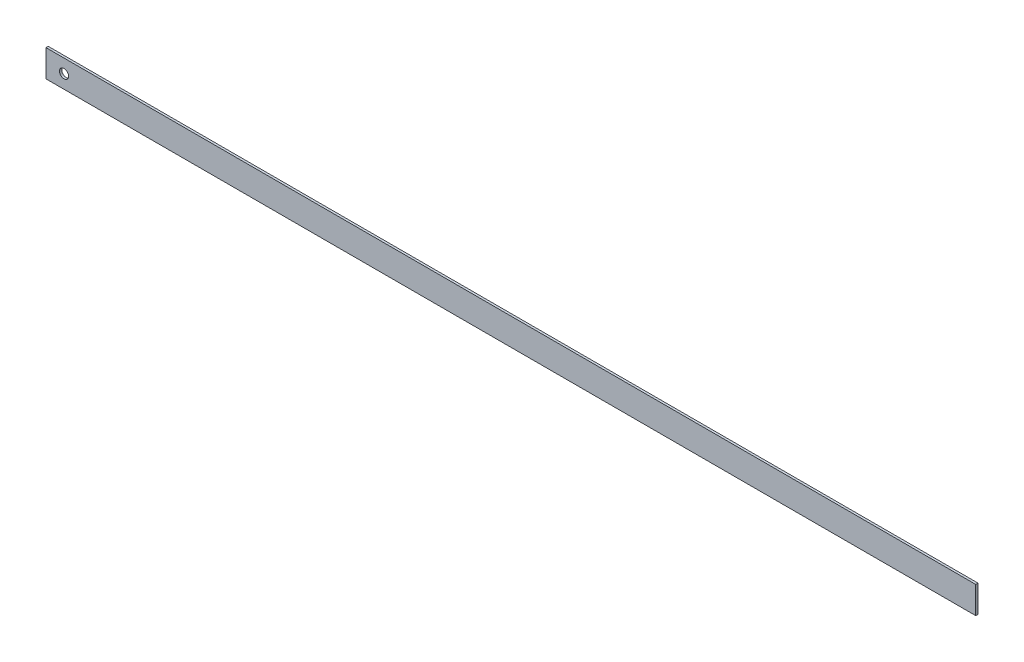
ISO-10303-21;
HEADER;
FILE_DESCRIPTION(('STEP AP214'),'2;1');
FILE_NAME('part.step','',(''),(''),'','','');
FILE_SCHEMA(('AUTOMOTIVE_DESIGN { 1 0 10303 214 1 1 1 1 }'));
ENDSEC;
DATA;
#1=APPLICATION_CONTEXT('core data for automotive mechanical design processes');
#2=APPLICATION_PROTOCOL_DEFINITION('international standard','automotive_design',2000,#1);
#3=PRODUCT_CONTEXT('',#1,'mechanical');
#4=PRODUCT('Part','Part','',(#3));
#5=PRODUCT_RELATED_PRODUCT_CATEGORY('part','',(#4));
#6=PRODUCT_DEFINITION_FORMATION('','',#4);
#7=PRODUCT_DEFINITION_CONTEXT('part definition',#1,'design');
#8=PRODUCT_DEFINITION('design','',#6,#7);
#9=PRODUCT_DEFINITION_SHAPE('','',#8);
#10=(LENGTH_UNIT() NAMED_UNIT(*) SI_UNIT(.MILLI.,.METRE.));
#11=(NAMED_UNIT(*) PLANE_ANGLE_UNIT() SI_UNIT($,.RADIAN.));
#12=(NAMED_UNIT(*) SI_UNIT($,.STERADIAN.) SOLID_ANGLE_UNIT());
#13=UNCERTAINTY_MEASURE_WITH_UNIT(LENGTH_MEASURE(1.E-05),#10,'distance_accuracy_value','');
#14=(GEOMETRIC_REPRESENTATION_CONTEXT(3) GLOBAL_UNCERTAINTY_ASSIGNED_CONTEXT((#13)) GLOBAL_UNIT_ASSIGNED_CONTEXT((#10,
#11,#12)) REPRESENTATION_CONTEXT('',''));
#15=CARTESIAN_POINT('',(0.,0.,0.));
#16=DIRECTION('',(0.,0.,1.));
#17=DIRECTION('',(1.,0.,0.));
#18=AXIS2_PLACEMENT_3D('',#15,#16,#17);
#19=CARTESIAN_POINT('',(0.,0.,1.5875));
#20=DIRECTION('',(0.,0.,1.));
#21=DIRECTION('',(1.,0.,0.));
#22=AXIS2_PLACEMENT_3D('',#19,#20,#21);
#23=PLANE('',#22);
#24=DIRECTION('',(0.,-1.,0.));
#25=VECTOR('',#24,1.);
#26=CARTESIAN_POINT('',(-654.05,19.0499999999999,1.5875));
#27=LINE('',#26,#25);
#28=CARTESIAN_POINT('',(-654.05,19.0499999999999,1.5875));
#29=VERTEX_POINT('',#28);
#30=CARTESIAN_POINT('',(-654.05,-1.2490009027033E-13,1.5875));
#31=VERTEX_POINT('',#30);
#32=EDGE_CURVE('E85',#29,#31,#27,.T.);
#33=ORIENTED_EDGE('',*,*,#32,.T.);
#34=DIRECTION('',(1.,0.,0.));
#35=VECTOR('',#34,1.);
#36=CARTESIAN_POINT('',(-654.05,-1.2490009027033E-13,1.5875));
#37=LINE('',#36,#35);
#38=CARTESIAN_POINT('',(0.,0.,1.5875));
#39=VERTEX_POINT('',#38);
#40=EDGE_CURVE('E80',#31,#39,#37,.T.);
#41=ORIENTED_EDGE('',*,*,#40,.T.);
#42=DIRECTION('',(0.,1.,0.));
#43=VECTOR('',#42,1.);
#44=CARTESIAN_POINT('',(0.,19.05,1.5875));
#45=LINE('',#44,#43);
#46=CARTESIAN_POINT('',(0.,19.05,1.5875));
#47=VERTEX_POINT('',#46);
#48=EDGE_CURVE('E83',#39,#47,#45,.T.);
#49=ORIENTED_EDGE('',*,*,#48,.T.);
#50=DIRECTION('',(-1.,0.,0.));
#51=VECTOR('',#50,1.);
#52=CARTESIAN_POINT('',(-654.05,19.0499999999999,1.5875));
#53=LINE('',#52,#51);
#54=EDGE_CURVE('E50',#47,#29,#53,.T.);
#55=ORIENTED_EDGE('',*,*,#54,.T.);
#56=EDGE_LOOP('',(#33,#41,#49,#55));
#57=FACE_BOUND('',#56,.T.);
#58=CARTESIAN_POINT('',(-641.35,9.52499999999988,1.5875));
#59=DIRECTION('',(0.,0.,1.));
#60=DIRECTION('',(1.,0.,0.));
#61=AXIS2_PLACEMENT_3D('',#58,#59,#60);
#62=CIRCLE('',#61,3.17500000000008);
#63=CARTESIAN_POINT('',(-638.175,9.52499999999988,1.5875));
#64=VERTEX_POINT('',#63);
#65=EDGE_CURVE('E100',#64,#64,#62,.T.);
#66=ORIENTED_EDGE('',*,*,#65,.F.);
#67=EDGE_LOOP('',(#66));
#68=FACE_BOUND('',#67,.T.);
#69=ADVANCED_FACE('F33',(#57,#68),#23,.T.);
#70=CARTESIAN_POINT('',(0.,0.,0.));
#71=DIRECTION('',(0.,0.,1.));
#72=DIRECTION('',(1.,0.,0.));
#73=AXIS2_PLACEMENT_3D('',#70,#71,#72);
#74=PLANE('',#73);
#75=DIRECTION('',(0.,-1.,0.));
#76=VECTOR('',#75,1.);
#77=CARTESIAN_POINT('',(-654.05,19.0499999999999,0.));
#78=LINE('',#77,#76);
#79=CARTESIAN_POINT('',(-654.05,19.0499999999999,0.));
#80=VERTEX_POINT('',#79);
#81=CARTESIAN_POINT('',(-654.05,-1.2490009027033E-13,0.));
#82=VERTEX_POINT('',#81);
#83=EDGE_CURVE('E97',#80,#82,#78,.T.);
#84=ORIENTED_EDGE('',*,*,#83,.F.);
#85=DIRECTION('',(-1.,0.,0.));
#86=VECTOR('',#85,1.);
#87=CARTESIAN_POINT('',(-654.05,19.0499999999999,0.));
#88=LINE('',#87,#86);
#89=CARTESIAN_POINT('',(0.,19.05,0.));
#90=VERTEX_POINT('',#89);
#91=EDGE_CURVE('E73',#90,#80,#88,.T.);
#92=ORIENTED_EDGE('',*,*,#91,.F.);
#93=DIRECTION('',(0.,1.,0.));
#94=VECTOR('',#93,1.);
#95=CARTESIAN_POINT('',(0.,19.05,0.));
#96=LINE('',#95,#94);
#97=CARTESIAN_POINT('',(0.,0.,0.));
#98=VERTEX_POINT('',#97);
#99=EDGE_CURVE('E67',#98,#90,#96,.T.);
#100=ORIENTED_EDGE('',*,*,#99,.F.);
#101=DIRECTION('',(1.,0.,0.));
#102=VECTOR('',#101,1.);
#103=CARTESIAN_POINT('',(-654.05,-1.2490009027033E-13,0.));
#104=LINE('',#103,#102);
#105=EDGE_CURVE('E89',#82,#98,#104,.T.);
#106=ORIENTED_EDGE('',*,*,#105,.F.);
#107=EDGE_LOOP('',(#84,#92,#100,#106));
#108=FACE_BOUND('',#107,.T.);
#109=CARTESIAN_POINT('',(-641.35,9.52499999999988,0.));
#110=DIRECTION('',(0.,0.,1.));
#111=DIRECTION('',(1.,0.,0.));
#112=AXIS2_PLACEMENT_3D('',#109,#110,#111);
#113=CIRCLE('',#112,3.17500000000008);
#114=CARTESIAN_POINT('',(-638.175,9.52499999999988,0.));
#115=VERTEX_POINT('',#114);
#116=EDGE_CURVE('E112',#115,#115,#113,.T.);
#117=ORIENTED_EDGE('',*,*,#116,.T.);
#118=EDGE_LOOP('',(#117));
#119=FACE_BOUND('',#118,.T.);
#120=ADVANCED_FACE('F108',(#108,#119),#74,.F.);
#121=CARTESIAN_POINT('',(-654.05,19.0499999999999,1.5875));
#122=DIRECTION('',(1.,0.,0.));
#123=DIRECTION('',(0.,0.,-1.));
#124=AXIS2_PLACEMENT_3D('',#121,#122,#123);
#125=PLANE('',#124);
#126=ORIENTED_EDGE('',*,*,#83,.T.);
#127=DIRECTION('',(0.,0.,-1.));
#128=VECTOR('',#127,1.);
#129=CARTESIAN_POINT('',(-654.05,-1.2490009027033E-13,1.5875));
#130=LINE('',#129,#128);
#131=EDGE_CURVE('E11',#31,#82,#130,.T.);
#132=ORIENTED_EDGE('',*,*,#131,.F.);
#133=ORIENTED_EDGE('',*,*,#32,.F.);
#134=DIRECTION('',(0.,0.,-1.));
#135=VECTOR('',#134,1.);
#136=CARTESIAN_POINT('',(-654.05,19.0499999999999,1.5875));
#137=LINE('',#136,#135);
#138=EDGE_CURVE('E93',#29,#80,#137,.T.);
#139=ORIENTED_EDGE('',*,*,#138,.T.);
#140=EDGE_LOOP('',(#126,#132,#133,#139));
#141=FACE_BOUND('',#140,.T.);
#142=ADVANCED_FACE('F35',(#141),#125,.F.);
#143=CARTESIAN_POINT('',(-654.05,-1.2490009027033E-13,1.5875));
#144=DIRECTION('',(0.,1.,0.));
#145=DIRECTION('',(-1.,0.,0.));
#146=AXIS2_PLACEMENT_3D('',#143,#144,#145);
#147=PLANE('',#146);
#148=ORIENTED_EDGE('',*,*,#105,.T.);
#149=DIRECTION('',(0.,0.,-1.));
#150=VECTOR('',#149,1.);
#151=CARTESIAN_POINT('',(0.,0.,1.5875));
#152=LINE('',#151,#150);
#153=EDGE_CURVE('E42',#39,#98,#152,.T.);
#154=ORIENTED_EDGE('',*,*,#153,.F.);
#155=ORIENTED_EDGE('',*,*,#40,.F.);
#156=ORIENTED_EDGE('',*,*,#131,.T.);
#157=EDGE_LOOP('',(#148,#154,#155,#156));
#158=FACE_BOUND('',#157,.T.);
#159=ADVANCED_FACE('F88',(#158),#147,.F.);
#160=CARTESIAN_POINT('',(0.,19.05,1.5875));
#161=DIRECTION('',(-1.,0.,0.));
#162=DIRECTION('',(0.,0.,1.));
#163=AXIS2_PLACEMENT_3D('',#160,#161,#162);
#164=PLANE('',#163);
#165=ORIENTED_EDGE('',*,*,#99,.T.);
#166=DIRECTION('',(0.,0.,-1.));
#167=VECTOR('',#166,1.);
#168=CARTESIAN_POINT('',(0.,19.05,1.5875));
#169=LINE('',#168,#167);
#170=EDGE_CURVE('E90',#47,#90,#169,.T.);
#171=ORIENTED_EDGE('',*,*,#170,.F.);
#172=ORIENTED_EDGE('',*,*,#48,.F.);
#173=ORIENTED_EDGE('',*,*,#153,.T.);
#174=EDGE_LOOP('',(#165,#171,#172,#173));
#175=FACE_BOUND('',#174,.T.);
#176=ADVANCED_FACE('F91',(#175),#164,.F.);
#177=CARTESIAN_POINT('',(-654.05,19.0499999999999,1.5875));
#178=DIRECTION('',(0.,-1.,0.));
#179=DIRECTION('',(1.,0.,0.));
#180=AXIS2_PLACEMENT_3D('',#177,#178,#179);
#181=PLANE('',#180);
#182=ORIENTED_EDGE('',*,*,#91,.T.);
#183=ORIENTED_EDGE('',*,*,#138,.F.);
#184=ORIENTED_EDGE('',*,*,#54,.F.);
#185=ORIENTED_EDGE('',*,*,#170,.T.);
#186=EDGE_LOOP('',(#182,#183,#184,#185));
#187=FACE_BOUND('',#186,.T.);
#188=ADVANCED_FACE('F105',(#187),#181,.F.);
#189=CARTESIAN_POINT('',(-641.35,9.52499999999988,1.5875));
#190=DIRECTION('',(0.,0.,-1.));
#191=DIRECTION('',(-1.,0.,0.));
#192=AXIS2_PLACEMENT_3D('',#189,#190,#191);
#193=CYLINDRICAL_SURFACE('',#192,3.17500000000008);
#194=ORIENTED_EDGE('',*,*,#65,.T.);
#195=EDGE_LOOP('',(#194));
#196=FACE_BOUND('',#195,.T.);
#197=ORIENTED_EDGE('',*,*,#116,.F.);
#198=EDGE_LOOP('',(#197));
#199=FACE_BOUND('',#198,.T.);
#200=ADVANCED_FACE('F118',(#196,#199),#193,.F.);
#201=CLOSED_SHELL('',(#69,#120,#142,#159,#176,#188,#200));
#202=MANIFOLD_SOLID_BREP('B2',#201);
#203=ADVANCED_BREP_SHAPE_REPRESENTATION('',(#18,#202),#14);
#204=SHAPE_DEFINITION_REPRESENTATION(#9,#203);
ENDSEC;
END-ISO-10303-21;
